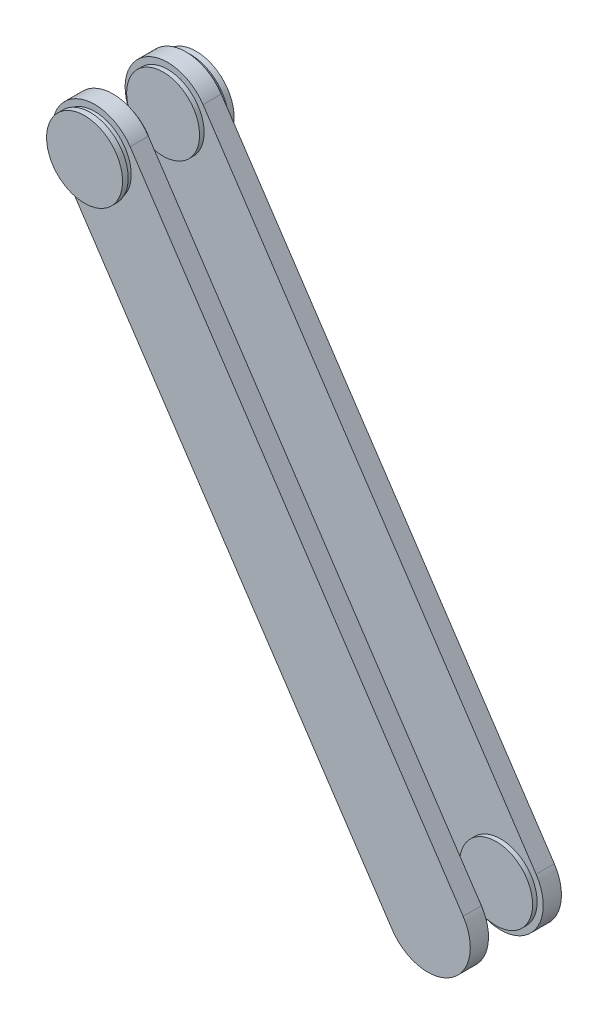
ISO-10303-21;
HEADER;
FILE_DESCRIPTION(('STEP AP214'),'2;1');
FILE_NAME('part.step','',(''),(''),'','','');
FILE_SCHEMA(('AUTOMOTIVE_DESIGN { 1 0 10303 214 1 1 1 1 }'));
ENDSEC;
DATA;
#1=APPLICATION_CONTEXT('core data for automotive mechanical design processes');
#2=APPLICATION_PROTOCOL_DEFINITION('international standard','automotive_design',2000,#1);
#3=PRODUCT_CONTEXT('',#1,'mechanical');
#4=PRODUCT('Part','Part','',(#3));
#5=PRODUCT_RELATED_PRODUCT_CATEGORY('part','',(#4));
#6=PRODUCT_DEFINITION_FORMATION('','',#4);
#7=PRODUCT_DEFINITION_CONTEXT('part definition',#1,'design');
#8=PRODUCT_DEFINITION('design','',#6,#7);
#9=PRODUCT_DEFINITION_SHAPE('','',#8);
#10=(LENGTH_UNIT() NAMED_UNIT(*) SI_UNIT(.MILLI.,.METRE.));
#11=(NAMED_UNIT(*) PLANE_ANGLE_UNIT() SI_UNIT($,.RADIAN.));
#12=(NAMED_UNIT(*) SI_UNIT($,.STERADIAN.) SOLID_ANGLE_UNIT());
#13=UNCERTAINTY_MEASURE_WITH_UNIT(LENGTH_MEASURE(1.E-05),#10,'distance_accuracy_value','');
#14=(GEOMETRIC_REPRESENTATION_CONTEXT(3) GLOBAL_UNCERTAINTY_ASSIGNED_CONTEXT((#13)) GLOBAL_UNIT_ASSIGNED_CONTEXT((#10,
#11,#12)) REPRESENTATION_CONTEXT('',''));
#15=CARTESIAN_POINT('',(0.,0.,0.));
#16=DIRECTION('',(0.,0.,1.));
#17=DIRECTION('',(1.,0.,0.));
#18=AXIS2_PLACEMENT_3D('',#15,#16,#17);
#19=CARTESIAN_POINT('',(-75.8673222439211,502.179269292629,-16.4977586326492));
#20=DIRECTION('',(0.,0.,-1.));
#21=DIRECTION('',(-1.,0.,0.));
#22=AXIS2_PLACEMENT_3D('',#19,#20,#21);
#23=PLANE('',#22);
#24=CARTESIAN_POINT('',(-75.8673222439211,502.179269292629,-16.4977586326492));
#25=DIRECTION('',(0.,0.,1.));
#26=DIRECTION('',(1.,0.,0.));
#27=AXIS2_PLACEMENT_3D('',#24,#25,#26);
#28=CIRCLE('',#27,12.0000004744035);
#29=CARTESIAN_POINT('',(-63.8673217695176,502.179269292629,-16.4977586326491));
#30=VERTEX_POINT('',#29);
#31=EDGE_CURVE('P0_E10',#30,#30,#28,.T.);
#32=ORIENTED_EDGE('',*,*,#31,.F.);
#33=EDGE_LOOP('',(#32));
#34=FACE_BOUND('',#33,.T.);
#35=ADVANCED_FACE('P0_F14',(#34),#23,.T.);
#36=CARTESIAN_POINT('',(-75.8673222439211,502.179269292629,-14.9977586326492));
#37=DIRECTION('',(0.,0.,1.));
#38=DIRECTION('',(1.,0.,0.));
#39=AXIS2_PLACEMENT_3D('',#36,#37,#38);
#40=PLANE('',#39);
#41=CARTESIAN_POINT('',(-75.8673222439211,502.179269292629,-14.9977586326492));
#42=DIRECTION('',(0.,0.,-1.));
#43=DIRECTION('',(-1.,0.,0.));
#44=AXIS2_PLACEMENT_3D('',#41,#42,#43);
#45=CIRCLE('',#44,12.0000004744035);
#46=CARTESIAN_POINT('',(-87.8673227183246,502.179269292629,-14.9977586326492));
#47=VERTEX_POINT('',#46);
#48=EDGE_CURVE('P0_E21',#47,#47,#45,.T.);
#49=ORIENTED_EDGE('',*,*,#48,.F.);
#50=EDGE_LOOP('',(#49));
#51=FACE_BOUND('',#50,.T.);
#52=ADVANCED_FACE('P0_F28',(#51),#40,.T.);
#53=CARTESIAN_POINT('',(-75.8673222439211,502.179269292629,-14.9977586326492));
#54=DIRECTION('',(0.,0.,-1.));
#55=DIRECTION('',(-1.,0.,0.));
#56=AXIS2_PLACEMENT_3D('',#53,#54,#55);
#57=CYLINDRICAL_SURFACE('',#56,12.0000004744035);
#58=ORIENTED_EDGE('',*,*,#31,.T.);
#59=EDGE_LOOP('',(#58));
#60=FACE_BOUND('',#59,.T.);
#61=ORIENTED_EDGE('',*,*,#48,.T.);
#62=EDGE_LOOP('',(#61));
#63=FACE_BOUND('',#62,.T.);
#64=ADVANCED_FACE('P0_F16',(#60,#63),#57,.T.);
#65=CLOSED_SHELL('',(#35,#52,#64));
#66=MANIFOLD_SOLID_BREP('P0_B1',#65);
#67=CARTESIAN_POINT('',(-75.8673222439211,502.179269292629,-18.3500000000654));
#68=DIRECTION('',(0.,0.,-1.));
#69=DIRECTION('',(-1.,0.,0.));
#70=AXIS2_PLACEMENT_3D('',#67,#68,#69);
#71=PLANE('',#70);
#72=CARTESIAN_POINT('',(-75.8673222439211,502.179269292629,-18.3500000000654));
#73=DIRECTION('',(0.,0.,1.));
#74=DIRECTION('',(1.,0.,0.));
#75=AXIS2_PLACEMENT_3D('',#72,#73,#74);
#76=CIRCLE('',#75,12.5000004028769);
#77=CARTESIAN_POINT('',(-63.3673218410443,502.179269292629,-18.3500000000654));
#78=VERTEX_POINT('',#77);
#79=EDGE_CURVE('P1_E10',#78,#78,#76,.T.);
#80=ORIENTED_EDGE('',*,*,#79,.F.);
#81=EDGE_LOOP('',(#80));
#82=FACE_BOUND('',#81,.T.);
#83=ADVANCED_FACE('P1_F14',(#82),#71,.T.);
#84=CARTESIAN_POINT('',(-75.8673222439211,502.179269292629,-16.4977586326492));
#85=DIRECTION('',(0.,0.,1.));
#86=DIRECTION('',(1.,0.,0.));
#87=AXIS2_PLACEMENT_3D('',#84,#85,#86);
#88=PLANE('',#87);
#89=CARTESIAN_POINT('',(-75.8673222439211,502.179269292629,-16.4977586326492));
#90=DIRECTION('',(0.,0.,-1.));
#91=DIRECTION('',(-1.,0.,0.));
#92=AXIS2_PLACEMENT_3D('',#89,#90,#91);
#93=CIRCLE('',#92,12.5000004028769);
#94=CARTESIAN_POINT('',(-88.367322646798,502.179269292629,-16.4977586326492));
#95=VERTEX_POINT('',#94);
#96=EDGE_CURVE('P1_E21',#95,#95,#93,.T.);
#97=ORIENTED_EDGE('',*,*,#96,.F.);
#98=EDGE_LOOP('',(#97));
#99=FACE_BOUND('',#98,.T.);
#100=ADVANCED_FACE('P1_F28',(#99),#88,.T.);
#101=CARTESIAN_POINT('',(-75.8673222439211,502.179269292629,-16.4977586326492));
#102=DIRECTION('',(0.,0.,-1.));
#103=DIRECTION('',(-1.,0.,0.));
#104=AXIS2_PLACEMENT_3D('',#101,#102,#103);
#105=CYLINDRICAL_SURFACE('',#104,12.5000004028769);
#106=ORIENTED_EDGE('',*,*,#79,.T.);
#107=EDGE_LOOP('',(#106));
#108=FACE_BOUND('',#107,.T.);
#109=ORIENTED_EDGE('',*,*,#96,.T.);
#110=EDGE_LOOP('',(#109));
#111=FACE_BOUND('',#110,.T.);
#112=ADVANCED_FACE('P1_F16',(#108,#111),#105,.T.);
#113=CLOSED_SHELL('',(#83,#100,#112));
#114=MANIFOLD_SOLID_BREP('P1_B1',#113);
#115=CARTESIAN_POINT('',(-75.8673222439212,502.179269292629,16.4977586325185));
#116=DIRECTION('',(0.,0.,-1.));
#117=DIRECTION('',(-1.,0.,0.));
#118=AXIS2_PLACEMENT_3D('',#115,#116,#117);
#119=PLANE('',#118);
#120=CARTESIAN_POINT('',(-75.8673222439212,502.179269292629,16.4977586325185));
#121=DIRECTION('',(0.,0.,1.));
#122=DIRECTION('',(1.,0.,0.));
#123=AXIS2_PLACEMENT_3D('',#120,#121,#122);
#124=CIRCLE('',#123,12.5000004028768);
#125=CARTESIAN_POINT('',(-63.3673218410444,502.179269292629,16.4977586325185));
#126=VERTEX_POINT('',#125);
#127=EDGE_CURVE('P2_E10',#126,#126,#124,.T.);
#128=ORIENTED_EDGE('',*,*,#127,.F.);
#129=EDGE_LOOP('',(#128));
#130=FACE_BOUND('',#129,.T.);
#131=ADVANCED_FACE('P2_F14',(#130),#119,.T.);
#132=CARTESIAN_POINT('',(-75.8673222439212,502.179269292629,18.3499999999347));
#133=DIRECTION('',(0.,0.,1.));
#134=DIRECTION('',(1.,0.,0.));
#135=AXIS2_PLACEMENT_3D('',#132,#133,#134);
#136=PLANE('',#135);
#137=CARTESIAN_POINT('',(-75.8673222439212,502.179269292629,18.3499999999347));
#138=DIRECTION('',(0.,0.,-1.));
#139=DIRECTION('',(-1.,0.,0.));
#140=AXIS2_PLACEMENT_3D('',#137,#138,#139);
#141=CIRCLE('',#140,12.5000004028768);
#142=CARTESIAN_POINT('',(-88.367322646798,502.179269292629,18.3499999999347));
#143=VERTEX_POINT('',#142);
#144=EDGE_CURVE('P2_E21',#143,#143,#141,.T.);
#145=ORIENTED_EDGE('',*,*,#144,.F.);
#146=EDGE_LOOP('',(#145));
#147=FACE_BOUND('',#146,.T.);
#148=ADVANCED_FACE('P2_F28',(#147),#136,.T.);
#149=CARTESIAN_POINT('',(-75.8673222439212,502.179269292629,18.3499999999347));
#150=DIRECTION('',(0.,0.,-1.));
#151=DIRECTION('',(-1.,0.,0.));
#152=AXIS2_PLACEMENT_3D('',#149,#150,#151);
#153=CYLINDRICAL_SURFACE('',#152,12.5000004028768);
#154=ORIENTED_EDGE('',*,*,#127,.T.);
#155=EDGE_LOOP('',(#154));
#156=FACE_BOUND('',#155,.T.);
#157=ORIENTED_EDGE('',*,*,#144,.T.);
#158=EDGE_LOOP('',(#157));
#159=FACE_BOUND('',#158,.T.);
#160=ADVANCED_FACE('P2_F16',(#156,#159),#153,.T.);
#161=CLOSED_SHELL('',(#131,#148,#160));
#162=MANIFOLD_SOLID_BREP('P2_B1',#161);
#163=CARTESIAN_POINT('',(-75.8673222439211,502.179269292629,14.9977586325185));
#164=DIRECTION('',(0.,0.,-1.));
#165=DIRECTION('',(-1.,0.,0.));
#166=AXIS2_PLACEMENT_3D('',#163,#164,#165);
#167=PLANE('',#166);
#168=CARTESIAN_POINT('',(-75.8673222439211,502.179269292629,14.9977586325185));
#169=DIRECTION('',(0.,0.,1.));
#170=DIRECTION('',(1.,0.,0.));
#171=AXIS2_PLACEMENT_3D('',#168,#169,#170);
#172=CIRCLE('',#171,12.0000004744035);
#173=CARTESIAN_POINT('',(-63.8673217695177,502.179269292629,14.9977586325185));
#174=VERTEX_POINT('',#173);
#175=EDGE_CURVE('P3_E10',#174,#174,#172,.T.);
#176=ORIENTED_EDGE('',*,*,#175,.F.);
#177=EDGE_LOOP('',(#176));
#178=FACE_BOUND('',#177,.T.);
#179=ADVANCED_FACE('P3_F14',(#178),#167,.T.);
#180=CARTESIAN_POINT('',(-75.8673222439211,502.179269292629,16.4977586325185));
#181=DIRECTION('',(0.,0.,1.));
#182=DIRECTION('',(1.,0.,0.));
#183=AXIS2_PLACEMENT_3D('',#180,#181,#182);
#184=PLANE('',#183);
#185=CARTESIAN_POINT('',(-75.8673222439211,502.179269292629,16.4977586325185));
#186=DIRECTION('',(0.,0.,-1.));
#187=DIRECTION('',(-1.,0.,0.));
#188=AXIS2_PLACEMENT_3D('',#185,#186,#187);
#189=CIRCLE('',#188,12.0000004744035);
#190=CARTESIAN_POINT('',(-87.8673227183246,502.179269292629,16.4977586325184));
#191=VERTEX_POINT('',#190);
#192=EDGE_CURVE('P3_E21',#191,#191,#189,.T.);
#193=ORIENTED_EDGE('',*,*,#192,.F.);
#194=EDGE_LOOP('',(#193));
#195=FACE_BOUND('',#194,.T.);
#196=ADVANCED_FACE('P3_F28',(#195),#184,.T.);
#197=CARTESIAN_POINT('',(-75.8673222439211,502.179269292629,16.4977586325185));
#198=DIRECTION('',(0.,0.,-1.));
#199=DIRECTION('',(-1.,0.,0.));
#200=AXIS2_PLACEMENT_3D('',#197,#198,#199);
#201=CYLINDRICAL_SURFACE('',#200,12.0000004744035);
#202=ORIENTED_EDGE('',*,*,#175,.T.);
#203=EDGE_LOOP('',(#202));
#204=FACE_BOUND('',#203,.T.);
#205=ORIENTED_EDGE('',*,*,#192,.T.);
#206=EDGE_LOOP('',(#205));
#207=FACE_BOUND('',#206,.T.);
#208=ADVANCED_FACE('P3_F16',(#204,#207),#201,.T.);
#209=CLOSED_SHELL('',(#179,#196,#208));
#210=MANIFOLD_SOLID_BREP('P3_B1',#209);
#211=CARTESIAN_POINT('',(-75.8673222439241,502.179269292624,7.49775863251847));
#212=DIRECTION('',(0.,0.,-1.));
#213=DIRECTION('',(-1.,0.,0.));
#214=AXIS2_PLACEMENT_3D('',#211,#212,#213);
#215=PLANE('',#214);
#216=CARTESIAN_POINT('',(-75.8673222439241,502.179269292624,7.49775863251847));
#217=DIRECTION('',(0.,0.,1.));
#218=DIRECTION('',(1.,0.,0.));
#219=AXIS2_PLACEMENT_3D('',#216,#217,#218);
#220=CIRCLE('',#219,12.0000004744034);
#221=CARTESIAN_POINT('',(-63.8673217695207,502.179269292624,7.49775863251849));
#222=VERTEX_POINT('',#221);
#223=EDGE_CURVE('P4_E10',#222,#222,#220,.T.);
#224=ORIENTED_EDGE('',*,*,#223,.F.);
#225=EDGE_LOOP('',(#224));
#226=FACE_BOUND('',#225,.T.);
#227=ADVANCED_FACE('P4_F14',(#226),#215,.T.);
#228=CARTESIAN_POINT('',(-75.8673222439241,502.179269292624,8.99775863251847));
#229=DIRECTION('',(0.,0.,1.));
#230=DIRECTION('',(1.,0.,0.));
#231=AXIS2_PLACEMENT_3D('',#228,#229,#230);
#232=PLANE('',#231);
#233=CARTESIAN_POINT('',(-75.8673222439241,502.179269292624,8.99775863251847));
#234=DIRECTION('',(0.,0.,-1.));
#235=DIRECTION('',(-1.,0.,0.));
#236=AXIS2_PLACEMENT_3D('',#233,#234,#235);
#237=CIRCLE('',#236,12.0000004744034);
#238=CARTESIAN_POINT('',(-87.8673227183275,502.179269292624,8.99775863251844));
#239=VERTEX_POINT('',#238);
#240=EDGE_CURVE('P4_E21',#239,#239,#237,.T.);
#241=ORIENTED_EDGE('',*,*,#240,.F.);
#242=EDGE_LOOP('',(#241));
#243=FACE_BOUND('',#242,.T.);
#244=ADVANCED_FACE('P4_F28',(#243),#232,.T.);
#245=CARTESIAN_POINT('',(-75.8673222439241,502.179269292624,8.99775863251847));
#246=DIRECTION('',(0.,0.,-1.));
#247=DIRECTION('',(-1.,0.,0.));
#248=AXIS2_PLACEMENT_3D('',#245,#246,#247);
#249=CYLINDRICAL_SURFACE('',#248,12.0000004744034);
#250=ORIENTED_EDGE('',*,*,#223,.T.);
#251=EDGE_LOOP('',(#250));
#252=FACE_BOUND('',#251,.T.);
#253=ORIENTED_EDGE('',*,*,#240,.T.);
#254=EDGE_LOOP('',(#253));
#255=FACE_BOUND('',#254,.T.);
#256=ADVANCED_FACE('P4_F16',(#252,#255),#249,.T.);
#257=CLOSED_SHELL('',(#227,#244,#256));
#258=MANIFOLD_SOLID_BREP('P4_B1',#257);
#259=CARTESIAN_POINT('',(-75.8673222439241,502.179269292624,-8.99775863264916));
#260=DIRECTION('',(0.,0.,-1.));
#261=DIRECTION('',(-1.,0.,0.));
#262=AXIS2_PLACEMENT_3D('',#259,#260,#261);
#263=PLANE('',#262);
#264=CARTESIAN_POINT('',(-75.8673222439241,502.179269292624,-8.99775863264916));
#265=DIRECTION('',(0.,0.,1.));
#266=DIRECTION('',(1.,0.,0.));
#267=AXIS2_PLACEMENT_3D('',#264,#265,#266);
#268=CIRCLE('',#267,12.0000004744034);
#269=CARTESIAN_POINT('',(-63.8673217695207,502.179269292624,-8.99775863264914));
#270=VERTEX_POINT('',#269);
#271=EDGE_CURVE('P5_E10',#270,#270,#268,.T.);
#272=ORIENTED_EDGE('',*,*,#271,.F.);
#273=EDGE_LOOP('',(#272));
#274=FACE_BOUND('',#273,.T.);
#275=ADVANCED_FACE('P5_F14',(#274),#263,.T.);
#276=CARTESIAN_POINT('',(-75.8673222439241,502.179269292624,-7.49775863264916));
#277=DIRECTION('',(0.,0.,1.));
#278=DIRECTION('',(1.,0.,0.));
#279=AXIS2_PLACEMENT_3D('',#276,#277,#278);
#280=PLANE('',#279);
#281=CARTESIAN_POINT('',(-75.8673222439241,502.179269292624,-7.49775863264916));
#282=DIRECTION('',(0.,0.,-1.));
#283=DIRECTION('',(-1.,0.,0.));
#284=AXIS2_PLACEMENT_3D('',#281,#282,#283);
#285=CIRCLE('',#284,12.0000004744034);
#286=CARTESIAN_POINT('',(-87.8673227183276,502.179269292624,-7.49775863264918));
#287=VERTEX_POINT('',#286);
#288=EDGE_CURVE('P5_E21',#287,#287,#285,.T.);
#289=ORIENTED_EDGE('',*,*,#288,.F.);
#290=EDGE_LOOP('',(#289));
#291=FACE_BOUND('',#290,.T.);
#292=ADVANCED_FACE('P5_F28',(#291),#280,.T.);
#293=CARTESIAN_POINT('',(-75.8673222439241,502.179269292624,-7.49775863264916));
#294=DIRECTION('',(0.,0.,-1.));
#295=DIRECTION('',(-1.,0.,0.));
#296=AXIS2_PLACEMENT_3D('',#293,#294,#295);
#297=CYLINDRICAL_SURFACE('',#296,12.0000004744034);
#298=ORIENTED_EDGE('',*,*,#271,.T.);
#299=EDGE_LOOP('',(#298));
#300=FACE_BOUND('',#299,.T.);
#301=ORIENTED_EDGE('',*,*,#288,.T.);
#302=EDGE_LOOP('',(#301));
#303=FACE_BOUND('',#302,.T.);
#304=ADVANCED_FACE('P5_F16',(#300,#303),#297,.T.);
#305=CLOSED_SHELL('',(#275,#292,#304));
#306=MANIFOLD_SOLID_BREP('P5_B1',#305);
#307=CARTESIAN_POINT('',(33.7167241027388,337.66438618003,8.99999999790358));
#308=DIRECTION('',(0.,0.,1.));
#309=DIRECTION('',(0.,-1.,0.));
#310=AXIS2_PLACEMENT_3D('',#307,#308,#309);
#311=PLANE('',#310);
#312=CARTESIAN_POINT('',(33.7167241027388,337.66438618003,8.99999999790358));
#313=DIRECTION('',(0.,0.,-1.));
#314=DIRECTION('',(0.,1.,0.));
#315=AXIS2_PLACEMENT_3D('',#312,#313,#314);
#316=CIRCLE('',#315,12.0000004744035);
#317=CARTESIAN_POINT('',(33.7167241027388,349.664386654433,8.99999999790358));
#318=VERTEX_POINT('',#317);
#319=EDGE_CURVE('P6_E10',#318,#318,#316,.T.);
#320=ORIENTED_EDGE('',*,*,#319,.F.);
#321=EDGE_LOOP('',(#320));
#322=FACE_BOUND('',#321,.T.);
#323=ADVANCED_FACE('P6_F14',(#322),#311,.T.);
#324=CARTESIAN_POINT('',(33.7167241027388,337.66438618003,7.49999999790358));
#325=DIRECTION('',(0.,0.,-1.));
#326=DIRECTION('',(0.,1.,0.));
#327=AXIS2_PLACEMENT_3D('',#324,#325,#326);
#328=PLANE('',#327);
#329=CARTESIAN_POINT('',(33.7167241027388,337.66438618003,7.49999999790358));
#330=DIRECTION('',(0.,0.,1.));
#331=DIRECTION('',(0.,-1.,0.));
#332=AXIS2_PLACEMENT_3D('',#329,#330,#331);
#333=CIRCLE('',#332,12.0000004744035);
#334=CARTESIAN_POINT('',(33.7167241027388,325.664385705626,7.49999999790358));
#335=VERTEX_POINT('',#334);
#336=EDGE_CURVE('P6_E21',#335,#335,#333,.T.);
#337=ORIENTED_EDGE('',*,*,#336,.F.);
#338=EDGE_LOOP('',(#337));
#339=FACE_BOUND('',#338,.T.);
#340=ADVANCED_FACE('P6_F28',(#339),#328,.T.);
#341=CARTESIAN_POINT('',(33.7167241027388,337.66438618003,7.49999999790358));
#342=DIRECTION('',(0.,0.,1.));
#343=DIRECTION('',(0.,-1.,0.));
#344=AXIS2_PLACEMENT_3D('',#341,#342,#343);
#345=CYLINDRICAL_SURFACE('',#344,12.0000004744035);
#346=ORIENTED_EDGE('',*,*,#319,.T.);
#347=EDGE_LOOP('',(#346));
#348=FACE_BOUND('',#347,.T.);
#349=ORIENTED_EDGE('',*,*,#336,.T.);
#350=EDGE_LOOP('',(#349));
#351=FACE_BOUND('',#350,.T.);
#352=ADVANCED_FACE('P6_F16',(#348,#351),#345,.T.);
#353=CLOSED_SHELL('',(#323,#340,#352));
#354=MANIFOLD_SOLID_BREP('P6_B1',#353);
#355=CARTESIAN_POINT('',(33.7167241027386,337.66438618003,-7.4977586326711));
#356=DIRECTION('',(0.,0.,1.));
#357=DIRECTION('',(0.,-1.,0.));
#358=AXIS2_PLACEMENT_3D('',#355,#356,#357);
#359=PLANE('',#358);
#360=CARTESIAN_POINT('',(33.7167241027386,337.66438618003,-7.4977586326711));
#361=DIRECTION('',(0.,0.,-1.));
#362=DIRECTION('',(0.,1.,0.));
#363=AXIS2_PLACEMENT_3D('',#360,#361,#362);
#364=CIRCLE('',#363,12.0000004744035);
#365=CARTESIAN_POINT('',(33.7167241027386,349.664386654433,-7.4977586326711));
#366=VERTEX_POINT('',#365);
#367=EDGE_CURVE('P7_E10',#366,#366,#364,.T.);
#368=ORIENTED_EDGE('',*,*,#367,.F.);
#369=EDGE_LOOP('',(#368));
#370=FACE_BOUND('',#369,.T.);
#371=ADVANCED_FACE('P7_F14',(#370),#359,.T.);
#372=CARTESIAN_POINT('',(33.7167241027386,337.66438618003,-8.9977586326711));
#373=DIRECTION('',(0.,0.,-1.));
#374=DIRECTION('',(0.,1.,0.));
#375=AXIS2_PLACEMENT_3D('',#372,#373,#374);
#376=PLANE('',#375);
#377=CARTESIAN_POINT('',(33.7167241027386,337.66438618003,-8.9977586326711));
#378=DIRECTION('',(0.,0.,1.));
#379=DIRECTION('',(0.,-1.,0.));
#380=AXIS2_PLACEMENT_3D('',#377,#378,#379);
#381=CIRCLE('',#380,12.0000004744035);
#382=CARTESIAN_POINT('',(33.7167241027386,325.664385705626,-8.9977586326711));
#383=VERTEX_POINT('',#382);
#384=EDGE_CURVE('P7_E21',#383,#383,#381,.T.);
#385=ORIENTED_EDGE('',*,*,#384,.F.);
#386=EDGE_LOOP('',(#385));
#387=FACE_BOUND('',#386,.T.);
#388=ADVANCED_FACE('P7_F28',(#387),#376,.T.);
#389=CARTESIAN_POINT('',(33.7167241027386,337.66438618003,-8.9977586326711));
#390=DIRECTION('',(0.,0.,1.));
#391=DIRECTION('',(0.,-1.,0.));
#392=AXIS2_PLACEMENT_3D('',#389,#390,#391);
#393=CYLINDRICAL_SURFACE('',#392,12.0000004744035);
#394=ORIENTED_EDGE('',*,*,#367,.T.);
#395=EDGE_LOOP('',(#394));
#396=FACE_BOUND('',#395,.T.);
#397=ORIENTED_EDGE('',*,*,#384,.T.);
#398=EDGE_LOOP('',(#397));
#399=FACE_BOUND('',#398,.T.);
#400=ADVANCED_FACE('P7_F16',(#396,#399),#393,.T.);
#401=CLOSED_SHELL('',(#371,#388,#400));
#402=MANIFOLD_SOLID_BREP('P7_B1',#401);
#403=CARTESIAN_POINT('',(-64.2155939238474,509.940533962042,14.9977586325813));
#404=DIRECTION('',(0.832266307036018,0.554376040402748,2.91119020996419E-13));
#405=DIRECTION('',(-0.554376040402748,0.832266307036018,0.));
#406=AXIS2_PLACEMENT_3D('',#403,#404,#405);
#407=PLANE('',#406);
#408=DIRECTION('',(0.554376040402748,-0.832266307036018,-3.00777540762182E-13));
#409=VECTOR('',#408,1.);
#410=CARTESIAN_POINT('',(-64.215593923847,509.940533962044,8.99775863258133));
#411=LINE('',#410,#409);
#412=CARTESIAN_POINT('',(-64.2155939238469,509.940533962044,8.99775863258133));
#413=VERTEX_POINT('',#412);
#414=CARTESIAN_POINT('',(45.3684524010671,345.425650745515,8.99775863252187));
#415=VERTEX_POINT('',#414);
#416=EDGE_CURVE('P8_E83',#413,#415,#411,.T.);
#417=ORIENTED_EDGE('',*,*,#416,.F.);
#418=DIRECTION('',(0.,4.11716423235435E-13,-1.));
#419=VECTOR('',#418,1.);
#420=CARTESIAN_POINT('',(-64.2155939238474,509.940533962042,14.9977586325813));
#421=LINE('',#420,#419);
#422=CARTESIAN_POINT('',(-64.2155939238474,509.940533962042,14.9977586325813));
#423=VERTEX_POINT('',#422);
#424=EDGE_CURVE('P8_E49',#423,#413,#421,.T.);
#425=ORIENTED_EDGE('',*,*,#424,.F.);
#426=DIRECTION('',(0.554376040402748,-0.832266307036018,-3.00777540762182E-13));
#427=VECTOR('',#426,1.);
#428=CARTESIAN_POINT('',(-64.2155939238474,509.940533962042,14.9977586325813));
#429=LINE('',#428,#427);
#430=CARTESIAN_POINT('',(45.3684524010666,345.425650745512,14.9977586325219));
#431=VERTEX_POINT('',#430);
#432=EDGE_CURVE('P8_E74',#423,#431,#429,.T.);
#433=ORIENTED_EDGE('',*,*,#432,.T.);
#434=DIRECTION('',(0.,4.11716423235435E-13,-1.));
#435=VECTOR('',#434,1.);
#436=CARTESIAN_POINT('',(45.3684524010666,345.425650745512,14.9977586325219));
#437=LINE('',#436,#435);
#438=EDGE_CURVE('P8_E11',#431,#415,#437,.T.);
#439=ORIENTED_EDGE('',*,*,#438,.T.);
#440=EDGE_LOOP('',(#417,#425,#433,#439));
#441=FACE_BOUND('',#440,.T.);
#442=ADVANCED_FACE('P8_F16',(#441),#407,.T.);
#443=CARTESIAN_POINT('',(33.7167241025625,337.664386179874,14.9977586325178));
#444=DIRECTION('',(0.,4.11716423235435E-13,-1.));
#445=DIRECTION('',(0.,1.,4.11716423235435E-13));
#446=AXIS2_PLACEMENT_3D('',#443,#444,#445);
#447=CYLINDRICAL_SURFACE('',#446,14.);
#448=CARTESIAN_POINT('',(33.7167241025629,337.664386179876,8.9977586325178));
#449=DIRECTION('',(0.,4.11716423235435E-13,-1.));
#450=DIRECTION('',(0.,-1.,-4.11716423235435E-13));
#451=AXIS2_PLACEMENT_3D('',#448,#449,#450);
#452=CIRCLE('',#451,14.);
#453=CARTESIAN_POINT('',(22.0649958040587,329.903121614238,8.99775863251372));
#454=VERTEX_POINT('',#453);
#455=EDGE_CURVE('P8_E71',#415,#454,#452,.T.);
#456=ORIENTED_EDGE('',*,*,#455,.F.);
#457=ORIENTED_EDGE('',*,*,#438,.F.);
#458=CARTESIAN_POINT('',(33.7167241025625,337.664386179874,14.9977586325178));
#459=DIRECTION('',(0.,4.11716423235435E-13,-1.));
#460=DIRECTION('',(0.,-1.,-4.11716423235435E-13));
#461=AXIS2_PLACEMENT_3D('',#458,#459,#460);
#462=CIRCLE('',#461,14.);
#463=CARTESIAN_POINT('',(22.0649958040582,329.903121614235,14.9977586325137));
#464=VERTEX_POINT('',#463);
#465=EDGE_CURVE('P8_E76',#431,#464,#462,.T.);
#466=ORIENTED_EDGE('',*,*,#465,.T.);
#467=DIRECTION('',(0.,4.11716423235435E-13,-1.));
#468=VECTOR('',#467,1.);
#469=CARTESIAN_POINT('',(22.0649958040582,329.903121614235,14.9977586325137));
#470=LINE('',#469,#468);
#471=EDGE_CURVE('P8_E20',#464,#454,#470,.T.);
#472=ORIENTED_EDGE('',*,*,#471,.T.);
#473=EDGE_LOOP('',(#456,#457,#466,#472));
#474=FACE_BOUND('',#473,.T.);
#475=ADVANCED_FACE('P8_F90',(#474),#447,.T.);
#476=CARTESIAN_POINT('',(22.0649958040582,329.903121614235,14.9977586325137));
#477=DIRECTION('',(-0.832266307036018,-0.554376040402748,-2.91119020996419E-13));
#478=DIRECTION('',(0.554376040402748,-0.832266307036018,0.));
#479=AXIS2_PLACEMENT_3D('',#476,#477,#478);
#480=PLANE('',#479);
#481=DIRECTION('',(-0.554376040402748,0.832266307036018,3.00777540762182E-13));
#482=VECTOR('',#481,1.);
#483=CARTESIAN_POINT('',(22.0649958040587,329.903121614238,8.99775863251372));
#484=LINE('',#483,#482);
#485=CARTESIAN_POINT('',(-87.5190505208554,494.418004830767,8.99775863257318));
#486=VERTEX_POINT('',#485);
#487=EDGE_CURVE('P8_E80',#454,#486,#484,.T.);
#488=ORIENTED_EDGE('',*,*,#487,.F.);
#489=ORIENTED_EDGE('',*,*,#471,.F.);
#490=DIRECTION('',(-0.554376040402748,0.832266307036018,3.00777540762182E-13));
#491=VECTOR('',#490,1.);
#492=CARTESIAN_POINT('',(22.0649958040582,329.903121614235,14.9977586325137));
#493=LINE('',#492,#491);
#494=CARTESIAN_POINT('',(-87.5190505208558,494.418004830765,14.9977586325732));
#495=VERTEX_POINT('',#494);
#496=EDGE_CURVE('P8_E69',#464,#495,#493,.T.);
#497=ORIENTED_EDGE('',*,*,#496,.T.);
#498=DIRECTION('',(0.,4.11716423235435E-13,-1.));
#499=VECTOR('',#498,1.);
#500=CARTESIAN_POINT('',(-87.5190505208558,494.418004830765,14.9977586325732));
#501=LINE('',#500,#499);
#502=EDGE_CURVE('P8_E61',#495,#486,#501,.T.);
#503=ORIENTED_EDGE('',*,*,#502,.T.);
#504=EDGE_LOOP('',(#488,#489,#497,#503));
#505=FACE_BOUND('',#504,.T.);
#506=ADVANCED_FACE('P8_F18',(#505),#480,.T.);
#507=CARTESIAN_POINT('',(-75.8673222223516,502.179269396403,14.9977586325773));
#508=DIRECTION('',(0.,4.11716423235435E-13,-1.));
#509=DIRECTION('',(0.,1.,4.11716423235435E-13));
#510=AXIS2_PLACEMENT_3D('',#507,#508,#509);
#511=CYLINDRICAL_SURFACE('',#510,14.);
#512=CARTESIAN_POINT('',(-75.8673222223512,502.179269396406,8.99775863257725));
#513=DIRECTION('',(0.,4.11716423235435E-13,-1.));
#514=DIRECTION('',(0.,-1.,-4.11716423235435E-13));
#515=AXIS2_PLACEMENT_3D('',#512,#513,#514);
#516=CIRCLE('',#515,14.);
#517=EDGE_CURVE('P8_E66',#486,#413,#516,.T.);
#518=ORIENTED_EDGE('',*,*,#517,.F.);
#519=ORIENTED_EDGE('',*,*,#502,.F.);
#520=CARTESIAN_POINT('',(-75.8673222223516,502.179269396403,14.9977586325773));
#521=DIRECTION('',(0.,4.11716423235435E-13,-1.));
#522=DIRECTION('',(0.,-1.,-4.11716423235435E-13));
#523=AXIS2_PLACEMENT_3D('',#520,#521,#522);
#524=CIRCLE('',#523,14.);
#525=EDGE_CURVE('P8_E64',#495,#423,#524,.T.);
#526=ORIENTED_EDGE('',*,*,#525,.T.);
#527=ORIENTED_EDGE('',*,*,#424,.T.);
#528=EDGE_LOOP('',(#518,#519,#526,#527));
#529=FACE_BOUND('',#528,.T.);
#530=ADVANCED_FACE('P8_F62',(#529),#511,.T.);
#531=CARTESIAN_POINT('',(-21.0752990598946,419.921827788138,14.9977586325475));
#532=DIRECTION('',(0.,4.11710853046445E-13,-1.));
#533=DIRECTION('',(0.,1.,4.11710853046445E-13));
#534=AXIS2_PLACEMENT_3D('',#531,#532,#533);
#535=PLANE('',#534);
#536=ORIENTED_EDGE('',*,*,#432,.F.);
#537=ORIENTED_EDGE('',*,*,#525,.F.);
#538=ORIENTED_EDGE('',*,*,#496,.F.);
#539=ORIENTED_EDGE('',*,*,#465,.F.);
#540=EDGE_LOOP('',(#536,#537,#538,#539));
#541=FACE_BOUND('',#540,.T.);
#542=ADVANCED_FACE('P8_F73',(#541),#535,.F.);
#543=CARTESIAN_POINT('',(-21.0752990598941,419.921827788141,8.99775863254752));
#544=DIRECTION('',(0.,4.11710853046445E-13,-1.));
#545=DIRECTION('',(0.,1.,4.11710853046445E-13));
#546=AXIS2_PLACEMENT_3D('',#543,#544,#545);
#547=PLANE('',#546);
#548=ORIENTED_EDGE('',*,*,#416,.T.);
#549=ORIENTED_EDGE('',*,*,#455,.T.);
#550=ORIENTED_EDGE('',*,*,#487,.T.);
#551=ORIENTED_EDGE('',*,*,#517,.T.);
#552=EDGE_LOOP('',(#548,#549,#550,#551));
#553=FACE_BOUND('',#552,.T.);
#554=ADVANCED_FACE('P8_F89',(#553),#547,.T.);
#555=CLOSED_SHELL('',(#442,#475,#506,#530,#542,#554));
#556=MANIFOLD_SOLID_BREP('P8_B1',#555);
#557=CARTESIAN_POINT('',(-64.2155939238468,509.940533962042,-8.99775863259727));
#558=DIRECTION('',(0.832266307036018,0.554376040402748,1.67465051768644E-13));
#559=DIRECTION('',(-0.554376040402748,0.832266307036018,0.));
#560=AXIS2_PLACEMENT_3D('',#557,#558,#559);
#561=PLANE('',#560);
#562=DIRECTION('',(0.554376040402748,-0.832266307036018,-2.49054435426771E-13));
#563=VECTOR('',#562,1.);
#564=CARTESIAN_POINT('',(-64.2155939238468,509.940533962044,-14.9977586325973));
#565=LINE('',#564,#563);
#566=CARTESIAN_POINT('',(-64.2155939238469,509.940533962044,-14.9977586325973));
#567=VERTEX_POINT('',#566);
#568=CARTESIAN_POINT('',(45.3684524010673,345.425650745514,-14.9977586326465));
#569=VERTEX_POINT('',#568);
#570=EDGE_CURVE('P9_E83',#567,#569,#565,.T.);
#571=ORIENTED_EDGE('',*,*,#570,.F.);
#572=DIRECTION('',(0.,3.00118227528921E-13,-1.));
#573=VECTOR('',#572,1.);
#574=CARTESIAN_POINT('',(-64.2155939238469,509.940533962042,-8.99775863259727));
#575=LINE('',#574,#573);
#576=CARTESIAN_POINT('',(-64.2155939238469,509.940533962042,-8.99775863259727));
#577=VERTEX_POINT('',#576);
#578=EDGE_CURVE('P9_E49',#577,#567,#575,.T.);
#579=ORIENTED_EDGE('',*,*,#578,.F.);
#580=DIRECTION('',(0.554376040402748,-0.832266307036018,-2.49054435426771E-13));
#581=VECTOR('',#580,1.);
#582=CARTESIAN_POINT('',(-64.2155939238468,509.940533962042,-8.99775863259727));
#583=LINE('',#582,#581);
#584=CARTESIAN_POINT('',(45.3684524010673,345.425650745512,-8.9977586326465));
#585=VERTEX_POINT('',#584);
#586=EDGE_CURVE('P9_E74',#577,#585,#583,.T.);
#587=ORIENTED_EDGE('',*,*,#586,.T.);
#588=DIRECTION('',(0.,3.00118227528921E-13,-1.));
#589=VECTOR('',#588,1.);
#590=CARTESIAN_POINT('',(45.3684524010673,345.425650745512,-8.9977586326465));
#591=LINE('',#590,#589);
#592=EDGE_CURVE('P9_E11',#585,#569,#591,.T.);
#593=ORIENTED_EDGE('',*,*,#592,.T.);
#594=EDGE_LOOP('',(#571,#579,#587,#593));
#595=FACE_BOUND('',#594,.T.);
#596=ADVANCED_FACE('P9_F16',(#595),#561,.T.);
#597=CARTESIAN_POINT('',(33.7167241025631,337.664386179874,-8.99775863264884));
#598=DIRECTION('',(0.,3.00118227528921E-13,-1.));
#599=DIRECTION('',(0.,1.,3.00118227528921E-13));
#600=AXIS2_PLACEMENT_3D('',#597,#598,#599);
#601=CYLINDRICAL_SURFACE('',#600,14.);
#602=CARTESIAN_POINT('',(33.7167241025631,337.664386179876,-14.9977586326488));
#603=DIRECTION('',(0.,3.00118227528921E-13,-1.));
#604=DIRECTION('',(0.,-1.,-3.00118227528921E-13));
#605=AXIS2_PLACEMENT_3D('',#602,#603,#604);
#606=CIRCLE('',#605,14.);
#607=CARTESIAN_POINT('',(22.0649958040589,329.903121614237,-14.9977586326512));
#608=VERTEX_POINT('',#607);
#609=EDGE_CURVE('P9_E71',#569,#608,#606,.T.);
#610=ORIENTED_EDGE('',*,*,#609,.F.);
#611=ORIENTED_EDGE('',*,*,#592,.F.);
#612=CARTESIAN_POINT('',(33.7167241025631,337.664386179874,-8.99775863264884));
#613=DIRECTION('',(0.,3.00118227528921E-13,-1.));
#614=DIRECTION('',(0.,-1.,-3.00118227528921E-13));
#615=AXIS2_PLACEMENT_3D('',#612,#613,#614);
#616=CIRCLE('',#615,14.);
#617=CARTESIAN_POINT('',(22.0649958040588,329.903121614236,-8.99775863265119));
#618=VERTEX_POINT('',#617);
#619=EDGE_CURVE('P9_E76',#585,#618,#616,.T.);
#620=ORIENTED_EDGE('',*,*,#619,.T.);
#621=DIRECTION('',(0.,3.00118227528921E-13,-1.));
#622=VECTOR('',#621,1.);
#623=CARTESIAN_POINT('',(22.0649958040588,329.903121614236,-8.99775863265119));
#624=LINE('',#623,#622);
#625=EDGE_CURVE('P9_E20',#618,#608,#624,.T.);
#626=ORIENTED_EDGE('',*,*,#625,.T.);
#627=EDGE_LOOP('',(#610,#611,#620,#626));
#628=FACE_BOUND('',#627,.T.);
#629=ADVANCED_FACE('P9_F90',(#628),#601,.T.);
#630=CARTESIAN_POINT('',(-87.5190505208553,494.418004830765,-8.99775863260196));
#631=DIRECTION('',(-0.832266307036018,-0.554376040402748,-1.67465051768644E-13));
#632=DIRECTION('',(0.554376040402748,-0.832266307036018,0.));
#633=AXIS2_PLACEMENT_3D('',#630,#631,#632);
#634=PLANE('',#633);
#635=DIRECTION('',(-0.554376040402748,0.832266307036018,2.49054435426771E-13));
#636=VECTOR('',#635,1.);
#637=CARTESIAN_POINT('',(-87.5190505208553,494.418004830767,-14.997758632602));
#638=LINE('',#637,#636);
#639=CARTESIAN_POINT('',(-87.5190505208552,494.418004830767,-14.997758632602));
#640=VERTEX_POINT('',#639);
#641=EDGE_CURVE('P9_E80',#608,#640,#638,.T.);
#642=ORIENTED_EDGE('',*,*,#641,.F.);
#643=ORIENTED_EDGE('',*,*,#625,.F.);
#644=DIRECTION('',(-0.554376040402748,0.832266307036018,2.49054435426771E-13));
#645=VECTOR('',#644,1.);
#646=CARTESIAN_POINT('',(-87.5190505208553,494.418004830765,-8.99775863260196));
#647=LINE('',#646,#645);
#648=CARTESIAN_POINT('',(-87.5190505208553,494.418004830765,-8.99775863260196));
#649=VERTEX_POINT('',#648);
#650=EDGE_CURVE('P9_E69',#618,#649,#647,.T.);
#651=ORIENTED_EDGE('',*,*,#650,.T.);
#652=DIRECTION('',(0.,3.00118227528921E-13,-1.));
#653=VECTOR('',#652,1.);
#654=CARTESIAN_POINT('',(-87.5190505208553,494.418004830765,-8.99775863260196));
#655=LINE('',#654,#653);
#656=EDGE_CURVE('P9_E61',#649,#640,#655,.T.);
#657=ORIENTED_EDGE('',*,*,#656,.T.);
#658=EDGE_LOOP('',(#642,#643,#651,#657));
#659=FACE_BOUND('',#658,.T.);
#660=ADVANCED_FACE('P9_F18',(#659),#634,.T.);
#661=CARTESIAN_POINT('',(-75.867322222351,502.179269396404,-8.99775863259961));
#662=DIRECTION('',(0.,3.00118227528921E-13,-1.));
#663=DIRECTION('',(0.,1.,3.00118227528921E-13));
#664=AXIS2_PLACEMENT_3D('',#661,#662,#663);
#665=CYLINDRICAL_SURFACE('',#664,14.);
#666=CARTESIAN_POINT('',(-75.867322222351,502.179269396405,-14.9977586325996));
#667=DIRECTION('',(0.,3.00118227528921E-13,-1.));
#668=DIRECTION('',(0.,-1.,-3.00118227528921E-13));
#669=AXIS2_PLACEMENT_3D('',#666,#667,#668);
#670=CIRCLE('',#669,14.);
#671=EDGE_CURVE('P9_E66',#640,#567,#670,.T.);
#672=ORIENTED_EDGE('',*,*,#671,.F.);
#673=ORIENTED_EDGE('',*,*,#656,.F.);
#674=CARTESIAN_POINT('',(-75.867322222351,502.179269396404,-8.99775863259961));
#675=DIRECTION('',(0.,3.00118227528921E-13,-1.));
#676=DIRECTION('',(0.,-1.,-3.00118227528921E-13));
#677=AXIS2_PLACEMENT_3D('',#674,#675,#676);
#678=CIRCLE('',#677,14.);
#679=EDGE_CURVE('P9_E64',#649,#577,#678,.T.);
#680=ORIENTED_EDGE('',*,*,#679,.T.);
#681=ORIENTED_EDGE('',*,*,#578,.T.);
#682=EDGE_LOOP('',(#672,#673,#680,#681));
#683=FACE_BOUND('',#682,.T.);
#684=ADVANCED_FACE('P9_F62',(#683),#665,.T.);
#685=CARTESIAN_POINT('',(-21.075299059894,419.921827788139,-8.99775863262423));
#686=DIRECTION('',(0.,3.00113634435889E-13,-1.));
#687=DIRECTION('',(0.,1.,3.00113634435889E-13));
#688=AXIS2_PLACEMENT_3D('',#685,#686,#687);
#689=PLANE('',#688);
#690=ORIENTED_EDGE('',*,*,#586,.F.);
#691=ORIENTED_EDGE('',*,*,#679,.F.);
#692=ORIENTED_EDGE('',*,*,#650,.F.);
#693=ORIENTED_EDGE('',*,*,#619,.F.);
#694=EDGE_LOOP('',(#690,#691,#692,#693));
#695=FACE_BOUND('',#694,.T.);
#696=ADVANCED_FACE('P9_F73',(#695),#689,.F.);
#697=CARTESIAN_POINT('',(-21.075299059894,419.921827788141,-14.9977586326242));
#698=DIRECTION('',(0.,3.00113634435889E-13,-1.));
#699=DIRECTION('',(0.,1.,3.00113634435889E-13));
#700=AXIS2_PLACEMENT_3D('',#697,#698,#699);
#701=PLANE('',#700);
#702=ORIENTED_EDGE('',*,*,#570,.T.);
#703=ORIENTED_EDGE('',*,*,#609,.T.);
#704=ORIENTED_EDGE('',*,*,#641,.T.);
#705=ORIENTED_EDGE('',*,*,#671,.T.);
#706=EDGE_LOOP('',(#702,#703,#704,#705));
#707=FACE_BOUND('',#706,.T.);
#708=ADVANCED_FACE('P9_F89',(#707),#701,.T.);
#709=CLOSED_SHELL('',(#596,#629,#660,#684,#696,#708));
#710=MANIFOLD_SOLID_BREP('P9_B1',#709);
#711=ADVANCED_BREP_SHAPE_REPRESENTATION('',(#18,#66,#114,#162,#210,#258,#306,#354,#402,#556,
#710),#14);
#712=SHAPE_DEFINITION_REPRESENTATION(#9,#711);
ENDSEC;
END-ISO-10303-21;
